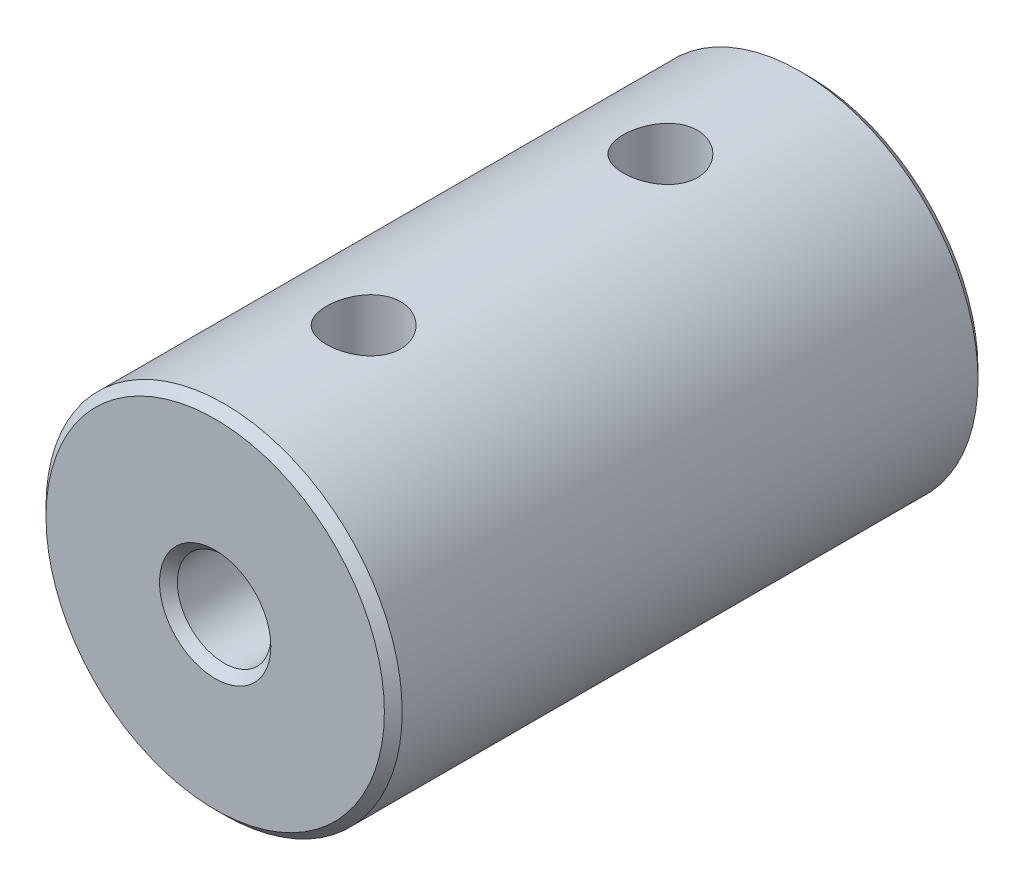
from build123d import *

# Parameters (mm, degrees)
ESQUISSE1_R             = 6
ESQUISSE1_R_2           = 1.075
BOSS_EXTRU_1_DEPTH      = 10
ESQUISSE2_R             = 1.575
ENL_V_MAT_EXTRU_1_DEPTH = 10
ESQUISSE3_R             = 1.25
ENL_V_MAT_EXTRU_2_DEPTH = 6
CHANFREIN1_SIZE         = 0.3


with BuildPart() as part:
    # Esquisse1 → Boss.-Extru.1 (new, symmetric)
    with BuildSketch(Plane.XY):
        Circle(ESQUISSE1_R)
        Circle(ESQUISSE1_R_2, mode=Mode.SUBTRACT)
    extrude(amount=BOSS_EXTRU_1_DEPTH, both=True)

    # Esquisse2 → Enl_v. mat.-Extru.1 (cut)
    with BuildSketch(Plane.XY.offset(10)):
        Circle(ESQUISSE2_R)
    extrude(amount=-ENL_V_MAT_EXTRU_1_DEPTH, mode=Mode.SUBTRACT)

    # Esquisse3 → Enl_v. mat.-Extru.2 (cut, symmetric)
    with BuildSketch(Plane(origin=(0, 0, 0), x_dir=(-1, 0, 0), z_dir=(0, 1, 0))):
        with Locations(Location((0, 5, 0), (0, 0, 90))):
            Circle(ESQUISSE3_R)
        with Locations(Location((0, -5, 0), (0, 0, 90))):
            Circle(ESQUISSE3_R)
    extrude(amount=ENL_V_MAT_EXTRU_2_DEPTH, both=True, mode=Mode.SUBTRACT)

    # Chanfrein1
    chanfrein1_edges = [part.edges().sort_by_distance(p)[0] for p in [
        (-1.575, 0, 10),
        (-6, 0, -10),
        (-6, 0, 10),
        (-1.075, 0, -10),
    ]]
    chamfer(chanfrein1_edges, length=CHANFREIN1_SIZE)


solid = part.part
